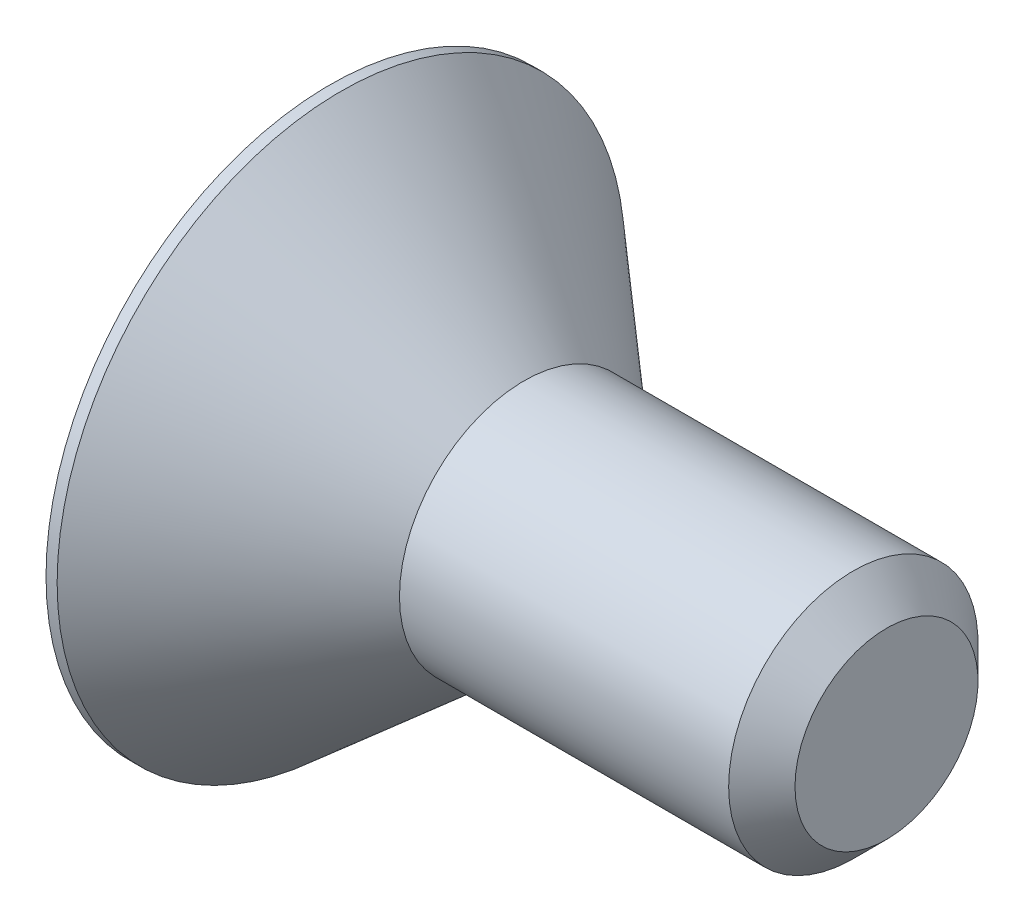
from build123d import *

# Parameters (mm, degrees)
HEX_2_DEPTH = 1.397


with BuildPart() as part:
    # BodySke → BaseBody (revolve)
    with BuildSketch(Plane.XY, mode=Mode.PRIVATE) as basebody_sk:
        Polygon((0, 0), (0, 3.2385), (0.127, 3.2385), (2.216184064, 1.4224), (5.97154, 1.4224), (6.35, 1.04394), (6.35, 0), align=None)
    revolve(basebody_sk.sketch.rotate(Axis((0, 0, 0), (1, 0, 0)), 90), axis=Axis((0, 0, 0), (1, 0, 0)))

    # Sketch2 → PreBroach (revolve, cut)
    with BuildSketch(Plane.XY, mode=Mode.PRIVATE) as prebroach_sk:
        Polygon((0, 0.79375), (1.397, 0.79375), (1.855271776, 0), (0, 0), align=None)
    revolve(prebroach_sk.sketch.rotate(Axis((0, 0, 0), (1, 0, 0)), 90), axis=Axis((0, 0, 0), (1, 0, 0)), mode=Mode.SUBTRACT)

    # Sketch3 → Hex 2 (cut)
    with BuildSketch(Plane.ZY):
        Polygon((-0.79375, -0.458271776), (-0.79375, 0.458271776), (0, 0.916543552), (0.79375, 0.458271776), (0.79375, -0.458271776), (0, -0.916543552), align=None)
    extrude(amount=-HEX_2_DEPTH, mode=Mode.SUBTRACT)


solid = part.part
